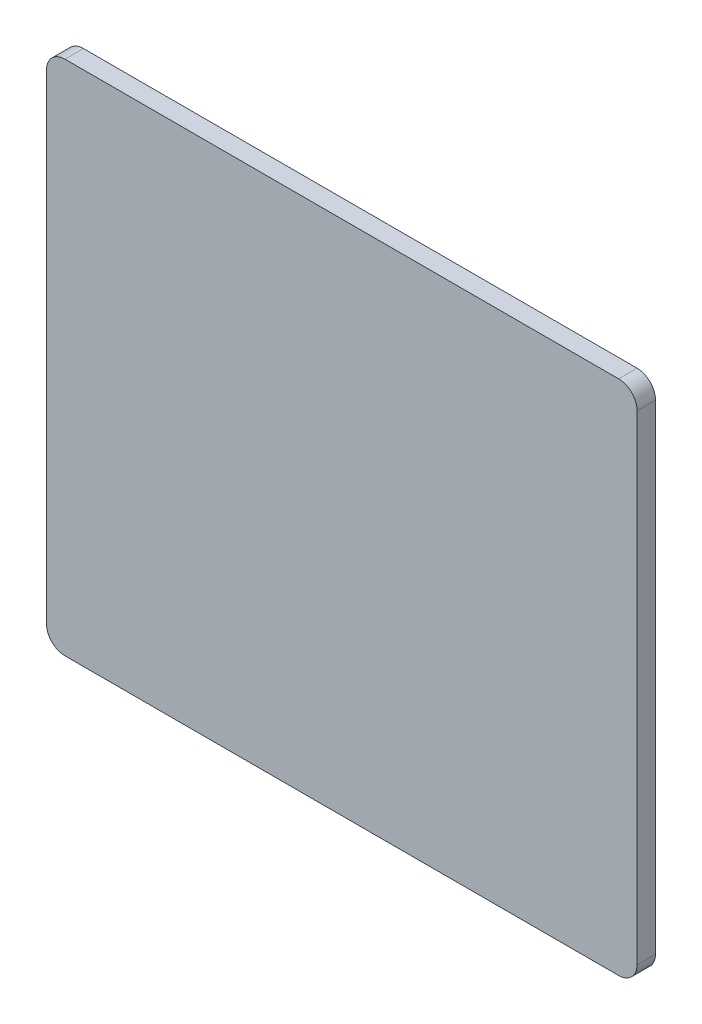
ISO-10303-21;
HEADER;
FILE_DESCRIPTION(('STEP AP214'),'2;1');
FILE_NAME('part.step','',(''),(''),'','','');
FILE_SCHEMA(('AUTOMOTIVE_DESIGN { 1 0 10303 214 1 1 1 1 }'));
ENDSEC;
DATA;
#1=APPLICATION_CONTEXT('core data for automotive mechanical design processes');
#2=APPLICATION_PROTOCOL_DEFINITION('international standard','automotive_design',2000,#1);
#3=PRODUCT_CONTEXT('',#1,'mechanical');
#4=PRODUCT('Part','Part','',(#3));
#5=PRODUCT_RELATED_PRODUCT_CATEGORY('part','',(#4));
#6=PRODUCT_DEFINITION_FORMATION('','',#4);
#7=PRODUCT_DEFINITION_CONTEXT('part definition',#1,'design');
#8=PRODUCT_DEFINITION('design','',#6,#7);
#9=PRODUCT_DEFINITION_SHAPE('','',#8);
#10=(LENGTH_UNIT() NAMED_UNIT(*) SI_UNIT(.MILLI.,.METRE.));
#11=(NAMED_UNIT(*) PLANE_ANGLE_UNIT() SI_UNIT($,.RADIAN.));
#12=(NAMED_UNIT(*) SI_UNIT($,.STERADIAN.) SOLID_ANGLE_UNIT());
#13=UNCERTAINTY_MEASURE_WITH_UNIT(LENGTH_MEASURE(1.E-05),#10,'distance_accuracy_value','');
#14=(GEOMETRIC_REPRESENTATION_CONTEXT(3) GLOBAL_UNCERTAINTY_ASSIGNED_CONTEXT((#13)) GLOBAL_UNIT_ASSIGNED_CONTEXT((#10,
#11,#12)) REPRESENTATION_CONTEXT('',''));
#15=CARTESIAN_POINT('',(0.,0.,0.));
#16=DIRECTION('',(0.,0.,1.));
#17=DIRECTION('',(1.,0.,0.));
#18=AXIS2_PLACEMENT_3D('',#15,#16,#17);
#19=CARTESIAN_POINT('',(1.,1.,1.));
#20=DIRECTION('',(0.,0.,-1.));
#21=DIRECTION('',(-1.,0.,0.));
#22=AXIS2_PLACEMENT_3D('',#19,#20,#21);
#23=CYLINDRICAL_SURFACE('',#22,1.);
#24=CARTESIAN_POINT('',(1.,1.,0.));
#25=DIRECTION('',(0.,0.,1.));
#26=DIRECTION('',(1.,0.,0.));
#27=AXIS2_PLACEMENT_3D('',#24,#25,#26);
#28=CIRCLE('',#27,1.);
#29=CARTESIAN_POINT('',(0.,1.00000000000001,0.));
#30=VERTEX_POINT('',#29);
#31=CARTESIAN_POINT('',(1.00000000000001,0.,0.));
#32=VERTEX_POINT('',#31);
#33=EDGE_CURVE('E99',#30,#32,#28,.T.);
#34=ORIENTED_EDGE('',*,*,#33,.T.);
#35=DIRECTION('',(0.,0.,-1.));
#36=VECTOR('',#35,1.);
#37=CARTESIAN_POINT('',(1.00000000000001,0.,1.));
#38=LINE('',#37,#36);
#39=CARTESIAN_POINT('',(1.00000000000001,0.,1.));
#40=VERTEX_POINT('',#39);
#41=EDGE_CURVE('E11',#40,#32,#38,.T.);
#42=ORIENTED_EDGE('',*,*,#41,.F.);
#43=CARTESIAN_POINT('',(1.,1.,1.));
#44=DIRECTION('',(0.,0.,1.));
#45=DIRECTION('',(1.,0.,0.));
#46=AXIS2_PLACEMENT_3D('',#43,#44,#45);
#47=CIRCLE('',#46,1.);
#48=CARTESIAN_POINT('',(0.,1.00000000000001,1.));
#49=VERTEX_POINT('',#48);
#50=EDGE_CURVE('E126',#49,#40,#47,.T.);
#51=ORIENTED_EDGE('',*,*,#50,.F.);
#52=DIRECTION('',(0.,0.,-1.));
#53=VECTOR('',#52,1.);
#54=CARTESIAN_POINT('',(0.,1.00000000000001,1.));
#55=LINE('',#54,#53);
#56=EDGE_CURVE('E112',#49,#30,#55,.T.);
#57=ORIENTED_EDGE('',*,*,#56,.T.);
#58=EDGE_LOOP('',(#34,#42,#51,#57));
#59=FACE_BOUND('',#58,.T.);
#60=ADVANCED_FACE('F31',(#59),#23,.T.);
#61=CARTESIAN_POINT('',(1.00000000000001,0.,1.));
#62=DIRECTION('',(0.,1.,0.));
#63=DIRECTION('',(0.,0.,1.));
#64=AXIS2_PLACEMENT_3D('',#61,#62,#63);
#65=PLANE('',#64);
#66=DIRECTION('',(1.,0.,0.));
#67=VECTOR('',#66,1.);
#68=CARTESIAN_POINT('',(1.00000000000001,0.,0.));
#69=LINE('',#68,#67);
#70=CARTESIAN_POINT('',(31.,0.,0.));
#71=VERTEX_POINT('',#70);
#72=EDGE_CURVE('E95',#32,#71,#69,.T.);
#73=ORIENTED_EDGE('',*,*,#72,.T.);
#74=DIRECTION('',(0.,0.,-1.));
#75=VECTOR('',#74,1.);
#76=CARTESIAN_POINT('',(31.,0.,1.));
#77=LINE('',#76,#75);
#78=CARTESIAN_POINT('',(31.,0.,1.));
#79=VERTEX_POINT('',#78);
#80=EDGE_CURVE('E38',#79,#71,#77,.T.);
#81=ORIENTED_EDGE('',*,*,#80,.F.);
#82=DIRECTION('',(1.,0.,0.));
#83=VECTOR('',#82,1.);
#84=CARTESIAN_POINT('',(1.00000000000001,0.,1.));
#85=LINE('',#84,#83);
#86=EDGE_CURVE('E108',#40,#79,#85,.T.);
#87=ORIENTED_EDGE('',*,*,#86,.F.);
#88=ORIENTED_EDGE('',*,*,#41,.T.);
#89=EDGE_LOOP('',(#73,#81,#87,#88));
#90=FACE_BOUND('',#89,.T.);
#91=ADVANCED_FACE('F107',(#90),#65,.F.);
#92=CARTESIAN_POINT('',(31.,1.,1.));
#93=DIRECTION('',(0.,0.,-1.));
#94=DIRECTION('',(-1.,0.,0.));
#95=AXIS2_PLACEMENT_3D('',#92,#93,#94);
#96=CYLINDRICAL_SURFACE('',#95,1.);
#97=CARTESIAN_POINT('',(31.,1.,0.));
#98=DIRECTION('',(0.,0.,1.));
#99=DIRECTION('',(1.,0.,0.));
#100=AXIS2_PLACEMENT_3D('',#97,#98,#99);
#101=CIRCLE('',#100,1.);
#102=CARTESIAN_POINT('',(32.,1.00000000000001,0.));
#103=VERTEX_POINT('',#102);
#104=EDGE_CURVE('E101',#71,#103,#101,.T.);
#105=ORIENTED_EDGE('',*,*,#104,.T.);
#106=DIRECTION('',(0.,0.,-1.));
#107=VECTOR('',#106,1.);
#108=CARTESIAN_POINT('',(32.,1.00000000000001,1.));
#109=LINE('',#108,#107);
#110=CARTESIAN_POINT('',(32.,1.00000000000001,1.));
#111=VERTEX_POINT('',#110);
#112=EDGE_CURVE('E152',#111,#103,#109,.T.);
#113=ORIENTED_EDGE('',*,*,#112,.F.);
#114=CARTESIAN_POINT('',(31.,1.,1.));
#115=DIRECTION('',(0.,0.,1.));
#116=DIRECTION('',(1.,0.,0.));
#117=AXIS2_PLACEMENT_3D('',#114,#115,#116);
#118=CIRCLE('',#117,1.);
#119=EDGE_CURVE('E129',#79,#111,#118,.T.);
#120=ORIENTED_EDGE('',*,*,#119,.F.);
#121=ORIENTED_EDGE('',*,*,#80,.T.);
#122=EDGE_LOOP('',(#105,#113,#120,#121));
#123=FACE_BOUND('',#122,.T.);
#124=ADVANCED_FACE('F156',(#123),#96,.T.);
#125=CARTESIAN_POINT('',(32.,27.,1.));
#126=DIRECTION('',(-1.,0.,0.));
#127=DIRECTION('',(0.,0.,1.));
#128=AXIS2_PLACEMENT_3D('',#125,#126,#127);
#129=PLANE('',#128);
#130=DIRECTION('',(0.,1.,0.));
#131=VECTOR('',#130,1.);
#132=CARTESIAN_POINT('',(32.,27.,0.));
#133=LINE('',#132,#131);
#134=CARTESIAN_POINT('',(32.,27.,0.));
#135=VERTEX_POINT('',#134);
#136=EDGE_CURVE('E116',#103,#135,#133,.T.);
#137=ORIENTED_EDGE('',*,*,#136,.T.);
#138=DIRECTION('',(0.,0.,-1.));
#139=VECTOR('',#138,1.);
#140=CARTESIAN_POINT('',(32.,27.,1.));
#141=LINE('',#140,#139);
#142=CARTESIAN_POINT('',(32.,27.,1.));
#143=VERTEX_POINT('',#142);
#144=EDGE_CURVE('E149',#143,#135,#141,.T.);
#145=ORIENTED_EDGE('',*,*,#144,.F.);
#146=DIRECTION('',(0.,1.,0.));
#147=VECTOR('',#146,1.);
#148=CARTESIAN_POINT('',(32.,27.,1.));
#149=LINE('',#148,#147);
#150=EDGE_CURVE('E131',#111,#143,#149,.T.);
#151=ORIENTED_EDGE('',*,*,#150,.F.);
#152=ORIENTED_EDGE('',*,*,#112,.T.);
#153=EDGE_LOOP('',(#137,#145,#151,#152));
#154=FACE_BOUND('',#153,.T.);
#155=ADVANCED_FACE('F164',(#154),#129,.F.);
#156=CARTESIAN_POINT('',(31.,27.,1.));
#157=DIRECTION('',(0.,0.,-1.));
#158=DIRECTION('',(-1.,0.,0.));
#159=AXIS2_PLACEMENT_3D('',#156,#157,#158);
#160=CYLINDRICAL_SURFACE('',#159,1.);
#161=CARTESIAN_POINT('',(31.,27.,0.));
#162=DIRECTION('',(0.,0.,1.));
#163=DIRECTION('',(-1.,0.,0.));
#164=AXIS2_PLACEMENT_3D('',#161,#162,#163);
#165=CIRCLE('',#164,1.);
#166=CARTESIAN_POINT('',(31.,28.,0.));
#167=VERTEX_POINT('',#166);
#168=EDGE_CURVE('E118',#135,#167,#165,.T.);
#169=ORIENTED_EDGE('',*,*,#168,.T.);
#170=DIRECTION('',(0.,0.,-1.));
#171=VECTOR('',#170,1.);
#172=CARTESIAN_POINT('',(31.,28.,1.));
#173=LINE('',#172,#171);
#174=CARTESIAN_POINT('',(31.,28.,1.));
#175=VERTEX_POINT('',#174);
#176=EDGE_CURVE('E146',#175,#167,#173,.T.);
#177=ORIENTED_EDGE('',*,*,#176,.F.);
#178=CARTESIAN_POINT('',(31.,27.,1.));
#179=DIRECTION('',(0.,0.,1.));
#180=DIRECTION('',(-1.,0.,0.));
#181=AXIS2_PLACEMENT_3D('',#178,#179,#180);
#182=CIRCLE('',#181,1.);
#183=EDGE_CURVE('E133',#143,#175,#182,.T.);
#184=ORIENTED_EDGE('',*,*,#183,.F.);
#185=ORIENTED_EDGE('',*,*,#144,.T.);
#186=EDGE_LOOP('',(#169,#177,#184,#185));
#187=FACE_BOUND('',#186,.T.);
#188=ADVANCED_FACE('F167',(#187),#160,.T.);
#189=CARTESIAN_POINT('',(1.00000000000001,28.,1.));
#190=DIRECTION('',(0.,-1.,0.));
#191=DIRECTION('',(0.,0.,-1.));
#192=AXIS2_PLACEMENT_3D('',#189,#190,#191);
#193=PLANE('',#192);
#194=DIRECTION('',(-1.,0.,0.));
#195=VECTOR('',#194,1.);
#196=CARTESIAN_POINT('',(1.00000000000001,28.,0.));
#197=LINE('',#196,#195);
#198=CARTESIAN_POINT('',(1.00000000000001,28.,0.));
#199=VERTEX_POINT('',#198);
#200=EDGE_CURVE('E120',#167,#199,#197,.T.);
#201=ORIENTED_EDGE('',*,*,#200,.T.);
#202=DIRECTION('',(0.,0.,-1.));
#203=VECTOR('',#202,1.);
#204=CARTESIAN_POINT('',(1.00000000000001,28.,1.));
#205=LINE('',#204,#203);
#206=CARTESIAN_POINT('',(1.00000000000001,28.,1.));
#207=VERTEX_POINT('',#206);
#208=EDGE_CURVE('E143',#207,#199,#205,.T.);
#209=ORIENTED_EDGE('',*,*,#208,.F.);
#210=DIRECTION('',(-1.,0.,0.));
#211=VECTOR('',#210,1.);
#212=CARTESIAN_POINT('',(1.00000000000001,28.,1.));
#213=LINE('',#212,#211);
#214=EDGE_CURVE('E135',#175,#207,#213,.T.);
#215=ORIENTED_EDGE('',*,*,#214,.F.);
#216=ORIENTED_EDGE('',*,*,#176,.T.);
#217=EDGE_LOOP('',(#201,#209,#215,#216));
#218=FACE_BOUND('',#217,.T.);
#219=ADVANCED_FACE('F172',(#218),#193,.F.);
#220=CARTESIAN_POINT('',(1.,27.,1.));
#221=DIRECTION('',(0.,0.,-1.));
#222=DIRECTION('',(-1.,0.,0.));
#223=AXIS2_PLACEMENT_3D('',#220,#221,#222);
#224=CYLINDRICAL_SURFACE('',#223,1.);
#225=CARTESIAN_POINT('',(1.,27.,0.));
#226=DIRECTION('',(0.,0.,1.));
#227=DIRECTION('',(1.,0.,0.));
#228=AXIS2_PLACEMENT_3D('',#225,#226,#227);
#229=CIRCLE('',#228,1.);
#230=CARTESIAN_POINT('',(0.,27.,0.));
#231=VERTEX_POINT('',#230);
#232=EDGE_CURVE('E122',#199,#231,#229,.T.);
#233=ORIENTED_EDGE('',*,*,#232,.T.);
#234=DIRECTION('',(0.,0.,-1.));
#235=VECTOR('',#234,1.);
#236=CARTESIAN_POINT('',(0.,27.,1.));
#237=LINE('',#236,#235);
#238=CARTESIAN_POINT('',(0.,27.,1.));
#239=VERTEX_POINT('',#238);
#240=EDGE_CURVE('E140',#239,#231,#237,.T.);
#241=ORIENTED_EDGE('',*,*,#240,.F.);
#242=CARTESIAN_POINT('',(1.,27.,1.));
#243=DIRECTION('',(0.,0.,1.));
#244=DIRECTION('',(1.,0.,0.));
#245=AXIS2_PLACEMENT_3D('',#242,#243,#244);
#246=CIRCLE('',#245,1.);
#247=EDGE_CURVE('E50',#207,#239,#246,.T.);
#248=ORIENTED_EDGE('',*,*,#247,.F.);
#249=ORIENTED_EDGE('',*,*,#208,.T.);
#250=EDGE_LOOP('',(#233,#241,#248,#249));
#251=FACE_BOUND('',#250,.T.);
#252=ADVANCED_FACE('F175',(#251),#224,.T.);
#253=CARTESIAN_POINT('',(0.,27.,1.));
#254=DIRECTION('',(1.,0.,0.));
#255=DIRECTION('',(0.,0.,-1.));
#256=AXIS2_PLACEMENT_3D('',#253,#254,#255);
#257=PLANE('',#256);
#258=DIRECTION('',(0.,-1.,0.));
#259=VECTOR('',#258,1.);
#260=CARTESIAN_POINT('',(0.,27.,0.));
#261=LINE('',#260,#259);
#262=EDGE_CURVE('E124',#231,#30,#261,.T.);
#263=ORIENTED_EDGE('',*,*,#262,.T.);
#264=ORIENTED_EDGE('',*,*,#56,.F.);
#265=DIRECTION('',(0.,-1.,0.));
#266=VECTOR('',#265,1.);
#267=CARTESIAN_POINT('',(0.,27.,1.));
#268=LINE('',#267,#266);
#269=EDGE_CURVE('E45',#239,#49,#268,.T.);
#270=ORIENTED_EDGE('',*,*,#269,.F.);
#271=ORIENTED_EDGE('',*,*,#240,.T.);
#272=EDGE_LOOP('',(#263,#264,#270,#271));
#273=FACE_BOUND('',#272,.T.);
#274=ADVANCED_FACE('F177',(#273),#257,.F.);
#275=CARTESIAN_POINT('',(1.,1.,1.));
#276=DIRECTION('',(0.,0.,1.));
#277=DIRECTION('',(1.,0.,0.));
#278=AXIS2_PLACEMENT_3D('',#275,#276,#277);
#279=PLANE('',#278);
#280=ORIENTED_EDGE('',*,*,#50,.T.);
#281=ORIENTED_EDGE('',*,*,#86,.T.);
#282=ORIENTED_EDGE('',*,*,#119,.T.);
#283=ORIENTED_EDGE('',*,*,#150,.T.);
#284=ORIENTED_EDGE('',*,*,#183,.T.);
#285=ORIENTED_EDGE('',*,*,#214,.T.);
#286=ORIENTED_EDGE('',*,*,#247,.T.);
#287=ORIENTED_EDGE('',*,*,#269,.T.);
#288=EDGE_LOOP('',(#280,#281,#282,#283,#284,#285,#286,#287));
#289=FACE_BOUND('',#288,.T.);
#290=ADVANCED_FACE('F159',(#289),#279,.T.);
#291=CARTESIAN_POINT('',(1.,1.,0.));
#292=DIRECTION('',(0.,0.,1.));
#293=DIRECTION('',(1.,0.,0.));
#294=AXIS2_PLACEMENT_3D('',#291,#292,#293);
#295=PLANE('',#294);
#296=ORIENTED_EDGE('',*,*,#33,.F.);
#297=ORIENTED_EDGE('',*,*,#262,.F.);
#298=ORIENTED_EDGE('',*,*,#232,.F.);
#299=ORIENTED_EDGE('',*,*,#200,.F.);
#300=ORIENTED_EDGE('',*,*,#168,.F.);
#301=ORIENTED_EDGE('',*,*,#136,.F.);
#302=ORIENTED_EDGE('',*,*,#104,.F.);
#303=ORIENTED_EDGE('',*,*,#72,.F.);
#304=EDGE_LOOP('',(#296,#297,#298,#299,#300,#301,#302,#303));
#305=FACE_BOUND('',#304,.T.);
#306=ADVANCED_FACE('F96',(#305),#295,.F.);
#307=CLOSED_SHELL('',(#60,#91,#124,#155,#188,#219,#252,#274,#290,#306));
#308=MANIFOLD_SOLID_BREP('B2',#307);
#309=ADVANCED_BREP_SHAPE_REPRESENTATION('',(#18,#308),#14);
#310=SHAPE_DEFINITION_REPRESENTATION(#9,#309);
ENDSEC;
END-ISO-10303-21;
